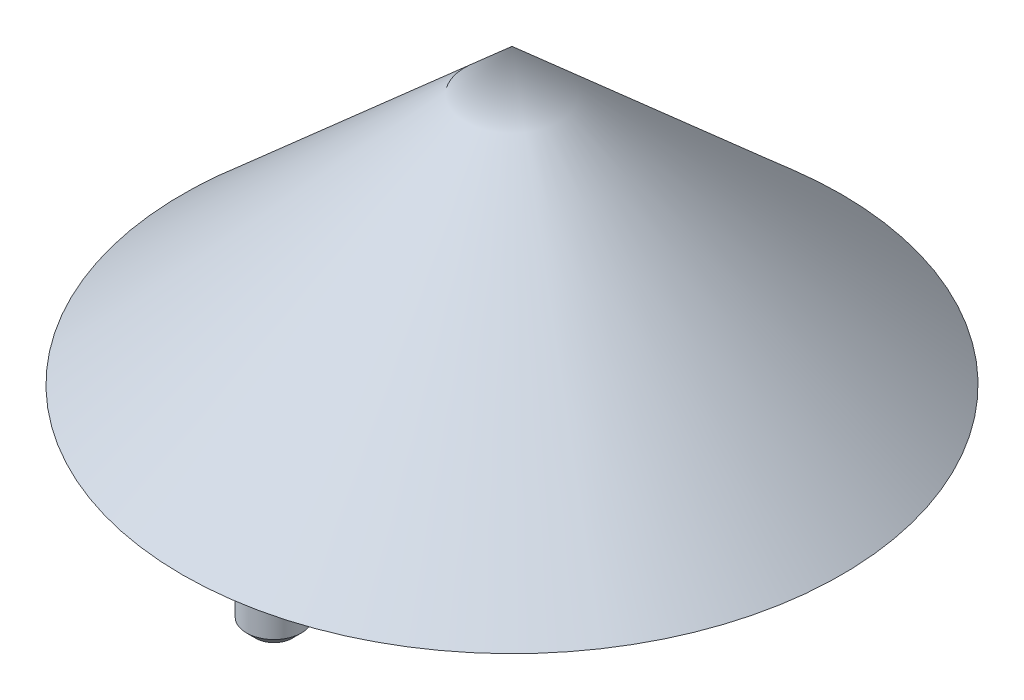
ISO-10303-21;
HEADER;
FILE_DESCRIPTION(('STEP AP214'),'2;1');
FILE_NAME('part.step','',(''),(''),'','','');
FILE_SCHEMA(('AUTOMOTIVE_DESIGN { 1 0 10303 214 1 1 1 1 }'));
ENDSEC;
DATA;
#1=APPLICATION_CONTEXT('core data for automotive mechanical design processes');
#2=APPLICATION_PROTOCOL_DEFINITION('international standard','automotive_design',2000,#1);
#3=PRODUCT_CONTEXT('',#1,'mechanical');
#4=PRODUCT('Part','Part','',(#3));
#5=PRODUCT_RELATED_PRODUCT_CATEGORY('part','',(#4));
#6=PRODUCT_DEFINITION_FORMATION('','',#4);
#7=PRODUCT_DEFINITION_CONTEXT('part definition',#1,'design');
#8=PRODUCT_DEFINITION('design','',#6,#7);
#9=PRODUCT_DEFINITION_SHAPE('','',#8);
#10=(LENGTH_UNIT() NAMED_UNIT(*) SI_UNIT(.MILLI.,.METRE.));
#11=(NAMED_UNIT(*) PLANE_ANGLE_UNIT() SI_UNIT($,.RADIAN.));
#12=(NAMED_UNIT(*) SI_UNIT($,.STERADIAN.) SOLID_ANGLE_UNIT());
#13=UNCERTAINTY_MEASURE_WITH_UNIT(LENGTH_MEASURE(1.E-05),#10,'distance_accuracy_value','');
#14=(GEOMETRIC_REPRESENTATION_CONTEXT(3) GLOBAL_UNCERTAINTY_ASSIGNED_CONTEXT((#13)) GLOBAL_UNIT_ASSIGNED_CONTEXT((#10,
#11,#12)) REPRESENTATION_CONTEXT('',''));
#15=CARTESIAN_POINT('',(0.,0.,0.));
#16=DIRECTION('',(0.,0.,1.));
#17=DIRECTION('',(1.,0.,0.));
#18=AXIS2_PLACEMENT_3D('',#15,#16,#17);
#19=CARTESIAN_POINT('',(18.,0.,0.));
#20=DIRECTION('',(0.,-1.,0.));
#21=DIRECTION('',(0.,0.,-1.));
#22=AXIS2_PLACEMENT_3D('',#19,#20,#21);
#23=PLANE('',#22);
#24=CARTESIAN_POINT('',(11.2583302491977,0.,-6.49999999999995));
#25=DIRECTION('',(0.,-1.,0.));
#26=DIRECTION('',(0.,0.,-1.));
#27=AXIS2_PLACEMENT_3D('',#24,#25,#26);
#28=CIRCLE('',#27,1.49999999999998);
#29=CARTESIAN_POINT('',(11.2583302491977,0.,-7.99999999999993));
#30=VERTEX_POINT('',#29);
#31=EDGE_CURVE('E110',#30,#30,#28,.T.);
#32=ORIENTED_EDGE('',*,*,#31,.F.);
#33=EDGE_LOOP('',(#32));
#34=FACE_BOUND('',#33,.T.);
#35=CARTESIAN_POINT('',(-11.2583302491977,0.,-6.49999999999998));
#36=DIRECTION('',(0.,-1.,0.));
#37=DIRECTION('',(0.,0.,-1.));
#38=AXIS2_PLACEMENT_3D('',#35,#36,#37);
#39=CIRCLE('',#38,1.5);
#40=CARTESIAN_POINT('',(-11.2583302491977,0.,-7.99999999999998));
#41=VERTEX_POINT('',#40);
#42=EDGE_CURVE('E58',#41,#41,#39,.T.);
#43=ORIENTED_EDGE('',*,*,#42,.F.);
#44=EDGE_LOOP('',(#43));
#45=FACE_BOUND('',#44,.T.);
#46=CARTESIAN_POINT('',(0.,0.,13.));
#47=DIRECTION('',(0.,-1.,0.));
#48=DIRECTION('',(0.,0.,-1.));
#49=AXIS2_PLACEMENT_3D('',#46,#47,#48);
#50=CIRCLE('',#49,1.5);
#51=CARTESIAN_POINT('',(0.,0.,11.5));
#52=VERTEX_POINT('',#51);
#53=EDGE_CURVE('E52',#52,#52,#50,.T.);
#54=ORIENTED_EDGE('',*,*,#53,.F.);
#55=EDGE_LOOP('',(#54));
#56=FACE_BOUND('',#55,.T.);
#57=CARTESIAN_POINT('',(0.,0.,0.));
#58=DIRECTION('',(0.,-1.,0.));
#59=DIRECTION('',(0.,0.,-1.));
#60=AXIS2_PLACEMENT_3D('',#57,#58,#59);
#61=CIRCLE('',#60,18.);
#62=CARTESIAN_POINT('',(0.,0.,-18.));
#63=VERTEX_POINT('',#62);
#64=EDGE_CURVE('E49',#63,#63,#61,.T.);
#65=ORIENTED_EDGE('',*,*,#64,.T.);
#66=EDGE_LOOP('',(#65));
#67=FACE_BOUND('',#66,.T.);
#68=ADVANCED_FACE('F32',(#34,#45,#56,#67),#23,.T.);
#69=CARTESIAN_POINT('',(0.,0.,0.));
#70=DIRECTION('',(0.,-1.,0.));
#71=DIRECTION('',(0.,0.,-1.));
#72=AXIS2_PLACEMENT_3D('',#69,#70,#71);
#73=CONICAL_SURFACE('',#72,18.,0.844153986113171);
#74=CARTESIAN_POINT('',(0.,16.,0.));
#75=VERTEX_POINT('',#74);
#76=VERTEX_LOOP('',#75);
#77=FACE_BOUND('',#76,.T.);
#78=ORIENTED_EDGE('',*,*,#64,.F.);
#79=EDGE_LOOP('',(#78));
#80=FACE_BOUND('',#79,.T.);
#81=ADVANCED_FACE('F42',(#77,#80),#73,.T.);
#82=CARTESIAN_POINT('',(0.,-5.,13.));
#83=DIRECTION('',(0.,1.,0.));
#84=DIRECTION('',(0.,0.,1.));
#85=AXIS2_PLACEMENT_3D('',#82,#83,#84);
#86=CYLINDRICAL_SURFACE('',#85,1.5);
#87=CARTESIAN_POINT('',(0.,-4.5,13.));
#88=DIRECTION('',(0.,-1.,0.));
#89=DIRECTION('',(0.,0.,-1.));
#90=AXIS2_PLACEMENT_3D('',#87,#88,#89);
#91=CIRCLE('',#90,1.5);
#92=CARTESIAN_POINT('',(0.,-4.5,11.5));
#93=VERTEX_POINT('',#92);
#94=EDGE_CURVE('E11',#93,#93,#91,.F.);
#95=ORIENTED_EDGE('',*,*,#94,.T.);
#96=EDGE_LOOP('',(#95));
#97=FACE_BOUND('',#96,.T.);
#98=ORIENTED_EDGE('',*,*,#53,.T.);
#99=EDGE_LOOP('',(#98));
#100=FACE_BOUND('',#99,.T.);
#101=ADVANCED_FACE('F45',(#97,#100),#86,.T.);
#102=CARTESIAN_POINT('',(0.,-5.,13.));
#103=DIRECTION('',(0.,-1.,0.));
#104=DIRECTION('',(0.,0.,-1.));
#105=AXIS2_PLACEMENT_3D('',#102,#103,#104);
#106=PLANE('',#105);
#107=CARTESIAN_POINT('',(0.,-5.,13.));
#108=DIRECTION('',(0.,-1.,0.));
#109=DIRECTION('',(0.,0.,-1.));
#110=AXIS2_PLACEMENT_3D('',#107,#108,#109);
#111=CIRCLE('',#110,1.00000000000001);
#112=CARTESIAN_POINT('',(0.,-5.,12.));
#113=VERTEX_POINT('',#112);
#114=EDGE_CURVE('E39',#113,#113,#111,.T.);
#115=ORIENTED_EDGE('',*,*,#114,.T.);
#116=EDGE_LOOP('',(#115));
#117=FACE_BOUND('',#116,.T.);
#118=ADVANCED_FACE('F72',(#117),#106,.T.);
#119=CARTESIAN_POINT('',(-11.2583302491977,-5.,-6.49999999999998));
#120=DIRECTION('',(0.,1.,0.));
#121=DIRECTION('',(0.,0.,1.));
#122=AXIS2_PLACEMENT_3D('',#119,#120,#121);
#123=CYLINDRICAL_SURFACE('',#122,1.5);
#124=CARTESIAN_POINT('',(-11.2583302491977,-4.5,-6.49999999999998));
#125=DIRECTION('',(0.,-1.,0.));
#126=DIRECTION('',(0.,0.,-1.));
#127=AXIS2_PLACEMENT_3D('',#124,#125,#126);
#128=CIRCLE('',#127,1.5);
#129=CARTESIAN_POINT('',(-11.2583302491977,-4.5,-7.99999999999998));
#130=VERTEX_POINT('',#129);
#131=EDGE_CURVE('E67',#130,#130,#128,.F.);
#132=ORIENTED_EDGE('',*,*,#131,.T.);
#133=EDGE_LOOP('',(#132));
#134=FACE_BOUND('',#133,.T.);
#135=ORIENTED_EDGE('',*,*,#42,.T.);
#136=EDGE_LOOP('',(#135));
#137=FACE_BOUND('',#136,.T.);
#138=ADVANCED_FACE('F115',(#134,#137),#123,.T.);
#139=CARTESIAN_POINT('',(-11.2583302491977,-5.,-6.49999999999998));
#140=DIRECTION('',(0.,-1.,0.));
#141=DIRECTION('',(0.,0.,-1.));
#142=AXIS2_PLACEMENT_3D('',#139,#140,#141);
#143=PLANE('',#142);
#144=CARTESIAN_POINT('',(-11.2583302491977,-5.,-6.49999999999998));
#145=DIRECTION('',(0.,-1.,0.));
#146=DIRECTION('',(0.,0.,-1.));
#147=AXIS2_PLACEMENT_3D('',#144,#145,#146);
#148=CIRCLE('',#147,1.);
#149=CARTESIAN_POINT('',(-11.2583302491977,-5.,-7.49999999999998));
#150=VERTEX_POINT('',#149);
#151=EDGE_CURVE('E64',#150,#150,#148,.T.);
#152=ORIENTED_EDGE('',*,*,#151,.T.);
#153=EDGE_LOOP('',(#152));
#154=FACE_BOUND('',#153,.T.);
#155=ADVANCED_FACE('F107',(#154),#143,.T.);
#156=CARTESIAN_POINT('',(11.2583302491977,-5.,-6.49999999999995));
#157=DIRECTION('',(0.,1.,0.));
#158=DIRECTION('',(0.,0.,1.));
#159=AXIS2_PLACEMENT_3D('',#156,#157,#158);
#160=CYLINDRICAL_SURFACE('',#159,1.49999999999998);
#161=CARTESIAN_POINT('',(11.2583302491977,-4.5,-6.49999999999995));
#162=DIRECTION('',(0.,-1.,0.));
#163=DIRECTION('',(0.,0.,-1.));
#164=AXIS2_PLACEMENT_3D('',#161,#162,#163);
#165=CIRCLE('',#164,1.49999999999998);
#166=CARTESIAN_POINT('',(11.2583302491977,-4.5,-7.99999999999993));
#167=VERTEX_POINT('',#166);
#168=EDGE_CURVE('E55',#167,#167,#165,.F.);
#169=ORIENTED_EDGE('',*,*,#168,.T.);
#170=EDGE_LOOP('',(#169));
#171=FACE_BOUND('',#170,.T.);
#172=ORIENTED_EDGE('',*,*,#31,.T.);
#173=EDGE_LOOP('',(#172));
#174=FACE_BOUND('',#173,.T.);
#175=ADVANCED_FACE('F98',(#171,#174),#160,.T.);
#176=CARTESIAN_POINT('',(11.2583302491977,-5.,-6.49999999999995));
#177=DIRECTION('',(0.,-1.,0.));
#178=DIRECTION('',(0.,0.,-1.));
#179=AXIS2_PLACEMENT_3D('',#176,#177,#178);
#180=PLANE('',#179);
#181=CARTESIAN_POINT('',(11.2583302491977,-5.,-6.49999999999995));
#182=DIRECTION('',(0.,-1.,0.));
#183=DIRECTION('',(0.,0.,-1.));
#184=AXIS2_PLACEMENT_3D('',#181,#182,#183);
#185=CIRCLE('',#184,0.999999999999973);
#186=CARTESIAN_POINT('',(11.2583302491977,-5.,-7.49999999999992));
#187=VERTEX_POINT('',#186);
#188=EDGE_CURVE('E51',#187,#187,#185,.T.);
#189=ORIENTED_EDGE('',*,*,#188,.T.);
#190=EDGE_LOOP('',(#189));
#191=FACE_BOUND('',#190,.T.);
#192=ADVANCED_FACE('F93',(#191),#180,.T.);
#193=CARTESIAN_POINT('',(11.2583302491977,-5.,-6.49999999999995));
#194=DIRECTION('',(0.,1.,0.));
#195=DIRECTION('',(0.,0.,1.));
#196=AXIS2_PLACEMENT_3D('',#193,#194,#195);
#197=CONICAL_SURFACE('',#196,0.999999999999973,0.78539816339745);
#198=ORIENTED_EDGE('',*,*,#168,.F.);
#199=EDGE_LOOP('',(#198));
#200=FACE_BOUND('',#199,.T.);
#201=ORIENTED_EDGE('',*,*,#188,.F.);
#202=EDGE_LOOP('',(#201));
#203=FACE_BOUND('',#202,.T.);
#204=ADVANCED_FACE('F80',(#200,#203),#197,.T.);
#205=CARTESIAN_POINT('',(-11.2583302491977,-5.,-6.49999999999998));
#206=DIRECTION('',(0.,1.,0.));
#207=DIRECTION('',(0.,0.,1.));
#208=AXIS2_PLACEMENT_3D('',#205,#206,#207);
#209=CONICAL_SURFACE('',#208,1.,0.78539816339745);
#210=ORIENTED_EDGE('',*,*,#131,.F.);
#211=EDGE_LOOP('',(#210));
#212=FACE_BOUND('',#211,.T.);
#213=ORIENTED_EDGE('',*,*,#151,.F.);
#214=EDGE_LOOP('',(#213));
#215=FACE_BOUND('',#214,.T.);
#216=ADVANCED_FACE('F75',(#212,#215),#209,.T.);
#217=CARTESIAN_POINT('',(0.,-5.,13.));
#218=DIRECTION('',(0.,1.,0.));
#219=DIRECTION('',(0.,0.,1.));
#220=AXIS2_PLACEMENT_3D('',#217,#218,#219);
#221=CONICAL_SURFACE('',#220,1.00000000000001,0.78539816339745);
#222=ORIENTED_EDGE('',*,*,#94,.F.);
#223=EDGE_LOOP('',(#222));
#224=FACE_BOUND('',#223,.T.);
#225=ORIENTED_EDGE('',*,*,#114,.F.);
#226=EDGE_LOOP('',(#225));
#227=FACE_BOUND('',#226,.T.);
#228=ADVANCED_FACE('F34',(#224,#227),#221,.T.);
#229=CLOSED_SHELL('',(#68,#81,#101,#118,#138,#155,#175,#192,#204,#216,#228));
#230=MANIFOLD_SOLID_BREP('B2',#229);
#231=ADVANCED_BREP_SHAPE_REPRESENTATION('',(#18,#230),#14);
#232=SHAPE_DEFINITION_REPRESENTATION(#9,#231);
ENDSEC;
END-ISO-10303-21;
